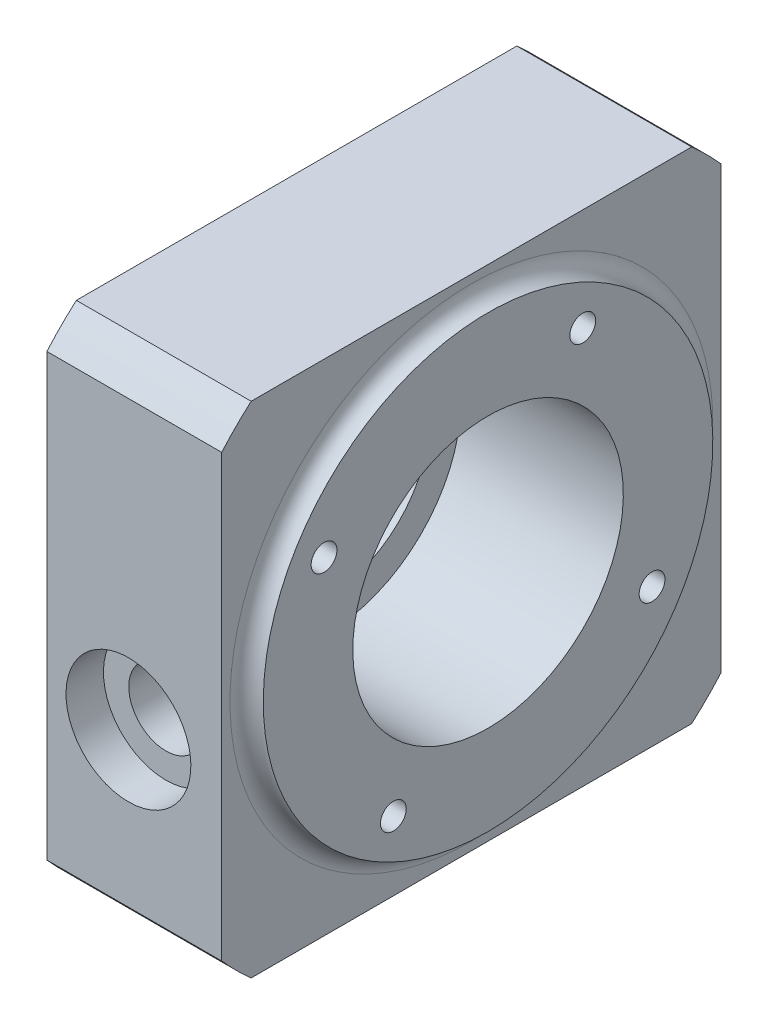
ISO-10303-21;
HEADER;
FILE_DESCRIPTION(('STEP AP214'),'2;1');
FILE_NAME('part.step','',(''),(''),'','','');
FILE_SCHEMA(('AUTOMOTIVE_DESIGN { 1 0 10303 214 1 1 1 1 }'));
ENDSEC;
DATA;
#1=APPLICATION_CONTEXT('core data for automotive mechanical design processes');
#2=APPLICATION_PROTOCOL_DEFINITION('international standard','automotive_design',2000,#1);
#3=PRODUCT_CONTEXT('',#1,'mechanical');
#4=PRODUCT('Part','Part','',(#3));
#5=PRODUCT_RELATED_PRODUCT_CATEGORY('part','',(#4));
#6=PRODUCT_DEFINITION_FORMATION('','',#4);
#7=PRODUCT_DEFINITION_CONTEXT('part definition',#1,'design');
#8=PRODUCT_DEFINITION('design','',#6,#7);
#9=PRODUCT_DEFINITION_SHAPE('','',#8);
#10=(LENGTH_UNIT() NAMED_UNIT(*) SI_UNIT(.MILLI.,.METRE.));
#11=(NAMED_UNIT(*) PLANE_ANGLE_UNIT() SI_UNIT($,.RADIAN.));
#12=(NAMED_UNIT(*) SI_UNIT($,.STERADIAN.) SOLID_ANGLE_UNIT());
#13=UNCERTAINTY_MEASURE_WITH_UNIT(LENGTH_MEASURE(1.E-05),#10,'distance_accuracy_value','');
#14=(GEOMETRIC_REPRESENTATION_CONTEXT(3) GLOBAL_UNCERTAINTY_ASSIGNED_CONTEXT((#13)) GLOBAL_UNIT_ASSIGNED_CONTEXT((#10,
#11,#12)) REPRESENTATION_CONTEXT('',''));
#15=CARTESIAN_POINT('',(0.,0.,0.));
#16=DIRECTION('',(0.,0.,1.));
#17=DIRECTION('',(1.,0.,0.));
#18=AXIS2_PLACEMENT_3D('',#15,#16,#17);
#19=CARTESIAN_POINT('',(-45.2,-8.,12.75));
#20=DIRECTION('',(0.,0.,1.));
#21=DIRECTION('',(0.,-1.,0.));
#22=AXIS2_PLACEMENT_3D('',#19,#20,#21);
#23=CYLINDRICAL_SURFACE('',#22,4.45873);
#24=CARTESIAN_POINT('',(-40.74127,-8.00000000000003,14.1443451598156));
#25=CARTESIAN_POINT('',(-40.7412657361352,-8.16556886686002,14.0507036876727));
#26=CARTESIAN_POINT('',(-40.7504902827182,-8.32943204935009,13.9541726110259));
#27=CARTESIAN_POINT('',(-40.786262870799,-8.65237658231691,13.7562618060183));
#28=CARTESIAN_POINT('',(-40.8128199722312,-8.81145538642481,13.6548795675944));
#29=CARTESIAN_POINT('',(-40.8822459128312,-9.12380042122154,13.4481940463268));
#30=CARTESIAN_POINT('',(-40.9251460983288,-9.27705485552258,13.3428835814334));
#31=CARTESIAN_POINT('',(-41.0262718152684,-9.57646114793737,13.1296481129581));
#32=CARTESIAN_POINT('',(-41.0844942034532,-9.72261445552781,13.0217236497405));
#33=CARTESIAN_POINT('',(-41.2085227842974,-9.99197770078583,12.8159467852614));
#34=CARTESIAN_POINT('',(-41.2728684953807,-10.1159764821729,12.7182409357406));
#35=CARTESIAN_POINT('',(-41.4127680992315,-10.3572427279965,12.5225454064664));
#36=CARTESIAN_POINT('',(-41.4883216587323,-10.4745103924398,12.4245557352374));
#37=CARTESIAN_POINT('',(-41.6503202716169,-10.7017596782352,12.2293605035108));
#38=CARTESIAN_POINT('',(-41.7367568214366,-10.8117468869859,12.1321543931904));
#39=CARTESIAN_POINT('',(-41.9204675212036,-11.0240109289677,11.9396066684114));
#40=CARTESIAN_POINT('',(-42.0177397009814,-11.1262891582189,11.8442647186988));
#41=CARTESIAN_POINT('',(-42.2033506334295,-11.3035573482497,11.6749333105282));
#42=CARTESIAN_POINT('',(-42.2897825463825,-11.3800008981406,11.6003783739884));
#43=CARTESIAN_POINT('',(-42.4698276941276,-11.5270314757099,11.4542929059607));
#44=CARTESIAN_POINT('',(-42.5634411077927,-11.5976183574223,11.382762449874));
#45=CARTESIAN_POINT('',(-42.8550963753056,-11.7996807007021,11.1743963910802));
#46=CARTESIAN_POINT('',(-43.0643272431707,-11.9218209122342,11.0434345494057));
#47=CARTESIAN_POINT('',(-43.4475678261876,-12.1036938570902,10.8432416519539));
#48=CARTESIAN_POINT('',(-43.6142609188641,-12.1712591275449,10.7671117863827));
#49=CARTESIAN_POINT('',(-43.9616400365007,-12.2872016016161,10.6346100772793));
#50=CARTESIAN_POINT('',(-44.1423024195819,-12.335610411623,10.5782057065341));
#51=CARTESIAN_POINT('',(-44.486514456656,-12.4042297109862,10.4976185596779));
#52=CARTESIAN_POINT('',(-44.6485933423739,-12.4275706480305,10.4698829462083));
#53=CARTESIAN_POINT('',(-44.9765522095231,-12.456161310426,10.4358551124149));
#54=CARTESIAN_POINT('',(-45.1424295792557,-12.4614231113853,10.429548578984));
#55=CARTESIAN_POINT('',(-45.4730965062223,-12.4534319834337,10.4390880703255));
#56=CARTESIAN_POINT('',(-45.6378858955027,-12.4401762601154,10.4549374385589));
#57=CARTESIAN_POINT('',(-45.9618131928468,-12.3962152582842,10.5070199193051));
#58=CARTESIAN_POINT('',(-46.120946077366,-12.3654948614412,10.5432706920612));
#59=CARTESIAN_POINT('',(-46.4768627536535,-12.2770177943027,10.6462753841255));
#60=CARTESIAN_POINT('',(-46.6705862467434,-12.2139100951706,10.7189227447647));
#61=CARTESIAN_POINT('',(-47.040208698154,-12.0661702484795,10.8849588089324));
#62=CARTESIAN_POINT('',(-47.2160659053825,-11.9814892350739,10.9783945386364));
#63=CARTESIAN_POINT('',(-47.5019212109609,-11.8210122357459,11.150599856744));
#64=CARTESIAN_POINT('',(-47.6164518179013,-11.7495085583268,11.2260125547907));
#65=CARTESIAN_POINT('',(-47.8362567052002,-11.598363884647,11.3821021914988));
#66=CARTESIAN_POINT('',(-47.9415269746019,-11.5187193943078,11.462781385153));
#67=CARTESIAN_POINT('',(-48.1430255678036,-11.3520123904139,11.6279013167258));
#68=CARTESIAN_POINT('',(-48.2392456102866,-11.264943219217,11.7123453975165));
#69=CARTESIAN_POINT('',(-48.4226456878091,-11.0840575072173,11.8836747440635));
#70=CARTESIAN_POINT('',(-48.5098268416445,-10.9902418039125,11.9705597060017));
#71=CARTESIAN_POINT('',(-48.7635105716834,-10.6927915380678,12.2392570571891));
#72=CARTESIAN_POINT('',(-48.9154846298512,-10.4787119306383,12.4235159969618));
#73=CARTESIAN_POINT('',(-49.1799628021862,-10.0269713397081,12.7909035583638));
#74=CARTESIAN_POINT('',(-49.2924901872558,-9.78932436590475,12.9740327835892));
#75=CARTESIAN_POINT('',(-49.4724251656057,-9.30087802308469,13.328329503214));
#76=CARTESIAN_POINT('',(-49.5410821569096,-9.05068502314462,13.4996909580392));
#77=CARTESIAN_POINT('',(-49.6342333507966,-8.53516825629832,13.8313859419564));
#78=CARTESIAN_POINT('',(-49.6587471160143,-8.26985124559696,13.9917243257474));
#79=CARTESIAN_POINT('',(-49.6587144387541,-7.75466124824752,14.28310236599));
#80=CARTESIAN_POINT('',(-49.6384222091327,-7.50557460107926,14.4154804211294));
#81=CARTESIAN_POINT('',(-49.5752013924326,-7.13171342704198,14.6020802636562));
#82=CARTESIAN_POINT('',(-49.5486471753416,-7.00700550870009,14.6623069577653));
#83=CARTESIAN_POINT('',(-49.4843247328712,-6.75851716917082,14.7784876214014));
#84=CARTESIAN_POINT('',(-49.4465612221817,-6.63473638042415,14.8344433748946));
#85=CARTESIAN_POINT('',(-49.359393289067,-6.38851670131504,14.9421393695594));
#86=CARTESIAN_POINT('',(-49.3099231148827,-6.26608963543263,14.9938534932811));
#87=CARTESIAN_POINT('',(-49.1994656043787,-6.02461023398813,15.0925005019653));
#88=CARTESIAN_POINT('',(-49.1384833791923,-5.90555642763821,15.1394354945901));
#89=CARTESIAN_POINT('',(-49.0051509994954,-5.67208905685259,15.2284443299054));
#90=CARTESIAN_POINT('',(-48.9328014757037,-5.55767523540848,15.2705184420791));
#91=CARTESIAN_POINT('',(-48.7770849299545,-5.33481523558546,15.3497959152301));
#92=CARTESIAN_POINT('',(-48.6937189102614,-5.22636851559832,15.3869997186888));
#93=CARTESIAN_POINT('',(-48.5244035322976,-5.0260713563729,15.4535186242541));
#94=CARTESIAN_POINT('',(-48.4393437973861,-4.93360275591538,15.4832410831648));
#95=CARTESIAN_POINT('',(-48.2610740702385,-4.75562648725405,15.5388290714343));
#96=CARTESIAN_POINT('',(-48.1678645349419,-4.67011842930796,15.5646948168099));
#97=CARTESIAN_POINT('',(-47.9739368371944,-4.50691961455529,15.6127324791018));
#98=CARTESIAN_POINT('',(-47.8732180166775,-4.42922954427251,15.634904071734));
#99=CARTESIAN_POINT('',(-47.6650274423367,-4.2824560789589,15.6757416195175));
#100=CARTESIAN_POINT('',(-47.5575559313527,-4.21337237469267,15.6944077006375));
#101=CARTESIAN_POINT('',(-47.3417886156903,-4.087470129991,15.7276549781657));
#102=CARTESIAN_POINT('',(-47.233759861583,-4.03023262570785,15.7423849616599));
#103=CARTESIAN_POINT('',(-47.0130829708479,-3.92471342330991,15.769023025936));
#104=CARTESIAN_POINT('',(-46.9004350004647,-3.87643140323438,15.7809312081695));
#105=CARTESIAN_POINT('',(-46.6714627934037,-3.78929254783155,15.8020812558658));
#106=CARTESIAN_POINT('',(-46.5551431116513,-3.75042451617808,15.8113262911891));
#107=CARTESIAN_POINT('',(-46.3195762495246,-3.68237892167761,15.8273120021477));
#108=CARTESIAN_POINT('',(-46.2003298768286,-3.65319871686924,15.8340533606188));
#109=CARTESIAN_POINT('',(-45.9353941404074,-3.59986082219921,15.8462742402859));
#110=CARTESIAN_POINT('',(-45.7892307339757,-3.57790967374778,15.8512234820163));
#111=CARTESIAN_POINT('',(-45.4953723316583,-3.54861466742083,15.857807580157));
#112=CARTESIAN_POINT('',(-45.3476773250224,-3.54127091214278,15.859442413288));
#113=CARTESIAN_POINT('',(-45.0778430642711,-3.54126924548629,15.8594420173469));
#114=CARTESIAN_POINT('',(-44.9556982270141,-3.54629275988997,15.8583230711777));
#115=CARTESIAN_POINT('',(-44.7122320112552,-3.5663472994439,15.8538252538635));
#116=CARTESIAN_POINT('',(-44.5909108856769,-3.58138126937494,15.8504457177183));
#117=CARTESIAN_POINT('',(-44.3498854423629,-3.62135679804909,15.8413602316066));
#118=CARTESIAN_POINT('',(-44.2301827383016,-3.6463075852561,15.8356521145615));
#119=CARTESIAN_POINT('',(-43.9933168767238,-3.70592166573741,15.8218071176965));
#120=CARTESIAN_POINT('',(-43.876154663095,-3.74058850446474,15.81366935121));
#121=CARTESIAN_POINT('',(-43.6453412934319,-3.81931035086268,15.7948410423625));
#122=CARTESIAN_POINT('',(-43.5316874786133,-3.86335803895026,15.7841524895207));
#123=CARTESIAN_POINT('',(-43.3085630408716,-3.96050127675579,15.7600581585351));
#124=CARTESIAN_POINT('',(-43.1990939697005,-4.01360014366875,15.7466513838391));
#125=CARTESIAN_POINT('',(-42.9852341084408,-4.12833373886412,15.7169611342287));
#126=CARTESIAN_POINT('',(-42.8808397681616,-4.18996238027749,15.7006797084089));
#127=CARTESIAN_POINT('',(-42.6777367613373,-4.32126524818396,15.6650500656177));
#128=CARTESIAN_POINT('',(-42.579030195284,-4.39094241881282,15.6457007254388));
#129=CARTESIAN_POINT('',(-42.3881206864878,-4.53761901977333,15.6037919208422));
#130=CARTESIAN_POINT('',(-42.2959107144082,-4.61461031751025,15.5812360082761));
#131=CARTESIAN_POINT('',(-42.118441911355,-4.77531265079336,15.5327374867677));
#132=CARTESIAN_POINT('',(-42.0331856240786,-4.85902612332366,15.5067936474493));
#133=CARTESIAN_POINT('',(-41.8702052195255,-5.03236009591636,15.4514117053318));
#134=CARTESIAN_POINT('',(-41.7924786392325,-5.12197864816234,15.421974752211));
#135=CARTESIAN_POINT('',(-41.644921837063,-5.30636982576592,15.359505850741));
#136=CARTESIAN_POINT('',(-41.5750945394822,-5.40114434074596,15.3264725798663));
#137=CARTESIAN_POINT('',(-41.4428709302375,-5.59619026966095,15.2563433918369));
#138=CARTESIAN_POINT('',(-41.3805777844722,-5.69651537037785,15.2192020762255));
#139=CARTESIAN_POINT('',(-41.2646528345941,-5.90068498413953,15.1412153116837));
#140=CARTESIAN_POINT('',(-41.2110242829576,-6.00453080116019,15.1003684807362));
#141=CARTESIAN_POINT('',(-41.063409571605,-6.31993012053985,14.9723807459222));
#142=CARTESIAN_POINT('',(-40.9825502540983,-6.5355607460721,14.8797164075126));
#143=CARTESIAN_POINT('',(-40.8587495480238,-6.96047399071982,14.6855868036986));
#144=CARTESIAN_POINT('',(-40.8142224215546,-7.1695867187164,14.5847296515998));
#145=CARTESIAN_POINT('',(-40.755477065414,-7.58667468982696,14.3721822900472));
#146=CARTESIAN_POINT('',(-40.7412752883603,-7.79464925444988,14.2604862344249));
#147=CARTESIAN_POINT('',(-40.74127,-8.00000000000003,14.1443451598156));
#148=B_SPLINE_CURVE_WITH_KNOTS('',3,(#24,#25,#26,#27,#28,#29,#30,#31,#32,#33,#34,#35,#36,#37,
#38,#39,#40,#41,#42,#43,#44,#45,#46,#47,#48,#49,#50,#51,#52,#53,#54,#55,#56,#57,#58,#59,#60,#61,
#62,#63,#64,#65,#66,#67,#68,#69,#70,#71,#72,#73,#74,#75,#76,#77,#78,#79,#80,#81,#82,#83,#84,#85,
#86,#87,#88,#89,#90,#91,#92,#93,#94,#95,#96,#97,#98,#99,#100,#101,#102,#103,#104,#105,#106,#107,
#108,#109,#110,#111,#112,#113,#114,#115,#116,#117,#118,#119,#120,#121,#122,#123,#124,#125,#126,
#127,#128,#129,#130,#131,#132,#133,#134,#135,#136,#137,#138,#139,#140,#141,#142,#143,#144,#145,
#146,#147),.UNSPECIFIED.,.T.,.F.,(4,2,2,2,2,2,2,2,2,2,2,2,2,2,2,2,2,2,2,2,2,2,2,2,2,2,2,2,2,2,2,
2,2,2,2,2,2,2,2,2,2,2,2,2,2,2,2,2,2,2,2,2,2,2,2,2,2,2,2,2,2,4),(0.,0.570315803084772,
1.14092995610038,1.71264411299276,2.28424107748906,2.79517961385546,3.30610296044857,
3.81662953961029,4.327063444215,4.73884637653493,5.15063956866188,5.97235634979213,
6.5564018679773,7.13947970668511,7.63552546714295,8.13123983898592,8.62702902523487,
9.12324804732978,9.76862072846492,10.4154684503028,10.8788487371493,11.3424287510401,
11.8064289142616,12.2703715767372,13.2289482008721,14.1869583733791,15.1163011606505,
16.0452319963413,16.8897814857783,17.3123881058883,17.7348172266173,18.1596777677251,
18.5843501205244,19.0089989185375,19.4336091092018,19.820444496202,20.2072582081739,
20.5941058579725,20.9809396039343,21.3499168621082,21.7188808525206,22.0874038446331,
22.4558262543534,22.8986990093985,23.3415748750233,23.7079165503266,24.0743660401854,
24.4411573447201,24.8080826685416,25.1747227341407,25.5414974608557,25.9080117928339,
26.2746606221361,26.6409064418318,27.0072856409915,27.3735445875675,27.7399386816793,
28.1108874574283,28.4819751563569,29.223349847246,29.9303142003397,30.6376620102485),.UNSPECIFIED.);
#149=CARTESIAN_POINT('',(-40.74127,-8.00000000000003,14.1443451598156));
#150=VERTEX_POINT('',#149);
#151=EDGE_CURVE('E158',#150,#150,#148,.T.);
#152=ORIENTED_EDGE('',*,*,#151,.T.);
#153=EDGE_LOOP('',(#152));
#154=FACE_BOUND('',#153,.T.);
#155=CARTESIAN_POINT('',(-45.2,-8.,25.5));
#156=DIRECTION('',(0.,0.,1.));
#157=DIRECTION('',(0.,-1.,0.));
#158=AXIS2_PLACEMENT_3D('',#155,#156,#157);
#159=CIRCLE('',#158,4.45873);
#160=CARTESIAN_POINT('',(-45.2,-12.45873,25.5));
#161=VERTEX_POINT('',#160);
#162=EDGE_CURVE('E180',#161,#161,#159,.T.);
#163=ORIENTED_EDGE('',*,*,#162,.T.);
#164=EDGE_LOOP('',(#163));
#165=FACE_BOUND('',#164,.T.);
#166=ADVANCED_FACE('F17',(#154,#165),#23,.F.);
#167=CARTESIAN_POINT('',(-32.,0.,0.));
#168=DIRECTION('',(1.,0.,0.));
#169=DIRECTION('',(0.,1.,0.));
#170=AXIS2_PLACEMENT_3D('',#167,#168,#169);
#171=PLANE('',#170);
#172=CARTESIAN_POINT('',(-32.,0.,0.));
#173=DIRECTION('',(-1.,0.,0.));
#174=DIRECTION('',(0.,-1.,0.));
#175=AXIS2_PLACEMENT_3D('',#172,#173,#174);
#176=CIRCLE('',#175,27.);
#177=CARTESIAN_POINT('',(-32.,-27.,0.));
#178=VERTEX_POINT('',#177);
#179=EDGE_CURVE('E183',#178,#178,#176,.F.);
#180=ORIENTED_EDGE('',*,*,#179,.T.);
#181=EDGE_LOOP('',(#180));
#182=FACE_BOUND('',#181,.T.);
#183=CARTESIAN_POINT('',(-32.,11.375,19.70207794));
#184=DIRECTION('',(-1.,0.,0.));
#185=DIRECTION('',(0.,-1.,0.));
#186=AXIS2_PLACEMENT_3D('',#183,#184,#185);
#187=CIRCLE('',#186,1.55);
#188=CARTESIAN_POINT('',(-32.,9.825,19.70207794));
#189=VERTEX_POINT('',#188);
#190=EDGE_CURVE('E177',#189,#189,#187,.T.);
#191=ORIENTED_EDGE('',*,*,#190,.T.);
#192=EDGE_LOOP('',(#191));
#193=FACE_BOUND('',#192,.T.);
#194=CARTESIAN_POINT('',(-32.,19.70207794,-11.375));
#195=DIRECTION('',(-1.,0.,0.));
#196=DIRECTION('',(0.,-1.,0.));
#197=AXIS2_PLACEMENT_3D('',#194,#195,#196);
#198=CIRCLE('',#197,1.55);
#199=CARTESIAN_POINT('',(-32.,18.15207794,-11.375));
#200=VERTEX_POINT('',#199);
#201=EDGE_CURVE('E173',#200,#200,#198,.T.);
#202=ORIENTED_EDGE('',*,*,#201,.T.);
#203=EDGE_LOOP('',(#202));
#204=FACE_BOUND('',#203,.T.);
#205=CARTESIAN_POINT('',(-32.,-11.375,-19.70207794));
#206=DIRECTION('',(-1.,0.,0.));
#207=DIRECTION('',(0.,-1.,0.));
#208=AXIS2_PLACEMENT_3D('',#205,#206,#207);
#209=CIRCLE('',#208,1.55);
#210=CARTESIAN_POINT('',(-32.,-12.925,-19.70207794));
#211=VERTEX_POINT('',#210);
#212=EDGE_CURVE('E170',#211,#211,#209,.T.);
#213=ORIENTED_EDGE('',*,*,#212,.T.);
#214=EDGE_LOOP('',(#213));
#215=FACE_BOUND('',#214,.T.);
#216=CARTESIAN_POINT('',(-32.,-19.70207794,11.375));
#217=DIRECTION('',(-1.,0.,0.));
#218=DIRECTION('',(0.,-1.,0.));
#219=AXIS2_PLACEMENT_3D('',#216,#217,#218);
#220=CIRCLE('',#219,1.55);
#221=CARTESIAN_POINT('',(-32.,-21.25207794,11.375));
#222=VERTEX_POINT('',#221);
#223=EDGE_CURVE('E167',#222,#222,#220,.T.);
#224=ORIENTED_EDGE('',*,*,#223,.T.);
#225=EDGE_LOOP('',(#224));
#226=FACE_BOUND('',#225,.T.);
#227=CARTESIAN_POINT('',(-32.,0.,0.));
#228=DIRECTION('',(-1.,0.,0.));
#229=DIRECTION('',(0.,-1.,0.));
#230=AXIS2_PLACEMENT_3D('',#227,#228,#229);
#231=CIRCLE('',#230,16.25);
#232=CARTESIAN_POINT('',(-32.,-16.25,0.));
#233=VERTEX_POINT('',#232);
#234=EDGE_CURVE('E163',#233,#233,#231,.T.);
#235=ORIENTED_EDGE('',*,*,#234,.T.);
#236=EDGE_LOOP('',(#235));
#237=FACE_BOUND('',#236,.T.);
#238=ADVANCED_FACE('F155',(#182,#193,#204,#215,#226,#237),#171,.T.);
#239=CARTESIAN_POINT('',(-40.75,0.,0.));
#240=DIRECTION('',(-1.,0.,0.));
#241=DIRECTION('',(0.,-1.,0.));
#242=AXIS2_PLACEMENT_3D('',#239,#240,#241);
#243=CYLINDRICAL_SURFACE('',#242,16.25);
#244=CARTESIAN_POINT('',(-51.5,0.,0.));
#245=DIRECTION('',(-1.,0.,0.));
#246=DIRECTION('',(0.,-1.,0.));
#247=AXIS2_PLACEMENT_3D('',#244,#245,#246);
#248=CIRCLE('',#247,16.25);
#249=CARTESIAN_POINT('',(-51.5,-16.25,0.));
#250=VERTEX_POINT('',#249);
#251=EDGE_CURVE('E187',#250,#250,#248,.T.);
#252=ORIENTED_EDGE('',*,*,#251,.T.);
#253=EDGE_LOOP('',(#252));
#254=FACE_BOUND('',#253,.T.);
#255=ORIENTED_EDGE('',*,*,#234,.F.);
#256=EDGE_LOOP('',(#255));
#257=FACE_BOUND('',#256,.T.);
#258=ORIENTED_EDGE('',*,*,#151,.F.);
#259=EDGE_LOOP('',(#258));
#260=FACE_BOUND('',#259,.T.);
#261=ADVANCED_FACE('F151',(#254,#257,#260),#243,.F.);
#262=CARTESIAN_POINT('',(-39.3,-19.70207794,11.375));
#263=DIRECTION('',(-1.,0.,0.));
#264=DIRECTION('',(0.,-1.,0.));
#265=AXIS2_PLACEMENT_3D('',#262,#263,#264);
#266=CYLINDRICAL_SURFACE('',#265,1.55);
#267=ORIENTED_EDGE('',*,*,#223,.F.);
#268=EDGE_LOOP('',(#267));
#269=FACE_BOUND('',#268,.T.);
#270=CARTESIAN_POINT('',(-46.6,-19.70207794,11.375));
#271=DIRECTION('',(-1.,0.,0.));
#272=DIRECTION('',(0.,-1.,0.));
#273=AXIS2_PLACEMENT_3D('',#270,#271,#272);
#274=CIRCLE('',#273,1.55);
#275=CARTESIAN_POINT('',(-46.6,-21.25207794,11.375));
#276=VERTEX_POINT('',#275);
#277=EDGE_CURVE('E191',#276,#276,#274,.T.);
#278=ORIENTED_EDGE('',*,*,#277,.T.);
#279=EDGE_LOOP('',(#278));
#280=FACE_BOUND('',#279,.T.);
#281=ADVANCED_FACE('F147',(#269,#280),#266,.F.);
#282=CARTESIAN_POINT('',(-39.3,-11.375,-19.70207794));
#283=DIRECTION('',(-1.,0.,0.));
#284=DIRECTION('',(0.,-1.,0.));
#285=AXIS2_PLACEMENT_3D('',#282,#283,#284);
#286=CYLINDRICAL_SURFACE('',#285,1.55);
#287=ORIENTED_EDGE('',*,*,#212,.F.);
#288=EDGE_LOOP('',(#287));
#289=FACE_BOUND('',#288,.T.);
#290=CARTESIAN_POINT('',(-46.6,-11.375,-19.70207794));
#291=DIRECTION('',(-1.,0.,0.));
#292=DIRECTION('',(0.,-1.,0.));
#293=AXIS2_PLACEMENT_3D('',#290,#291,#292);
#294=CIRCLE('',#293,1.55);
#295=CARTESIAN_POINT('',(-46.6,-12.925,-19.70207794));
#296=VERTEX_POINT('',#295);
#297=EDGE_CURVE('E194',#296,#296,#294,.T.);
#298=ORIENTED_EDGE('',*,*,#297,.T.);
#299=EDGE_LOOP('',(#298));
#300=FACE_BOUND('',#299,.T.);
#301=ADVANCED_FACE('F143',(#289,#300),#286,.F.);
#302=CARTESIAN_POINT('',(-39.3,19.70207794,-11.375));
#303=DIRECTION('',(-1.,0.,0.));
#304=DIRECTION('',(0.,-1.,0.));
#305=AXIS2_PLACEMENT_3D('',#302,#303,#304);
#306=CYLINDRICAL_SURFACE('',#305,1.55);
#307=ORIENTED_EDGE('',*,*,#201,.F.);
#308=EDGE_LOOP('',(#307));
#309=FACE_BOUND('',#308,.T.);
#310=CARTESIAN_POINT('',(-46.6,19.70207794,-11.375));
#311=DIRECTION('',(-1.,0.,0.));
#312=DIRECTION('',(0.,-1.,0.));
#313=AXIS2_PLACEMENT_3D('',#310,#311,#312);
#314=CIRCLE('',#313,1.55);
#315=CARTESIAN_POINT('',(-46.6,18.15207794,-11.375));
#316=VERTEX_POINT('',#315);
#317=EDGE_CURVE('E197',#316,#316,#314,.T.);
#318=ORIENTED_EDGE('',*,*,#317,.T.);
#319=EDGE_LOOP('',(#318));
#320=FACE_BOUND('',#319,.T.);
#321=ADVANCED_FACE('F139',(#309,#320),#306,.F.);
#322=CARTESIAN_POINT('',(-39.3,11.375,19.70207794));
#323=DIRECTION('',(-1.,0.,0.));
#324=DIRECTION('',(0.,-1.,0.));
#325=AXIS2_PLACEMENT_3D('',#322,#323,#324);
#326=CYLINDRICAL_SURFACE('',#325,1.55);
#327=ORIENTED_EDGE('',*,*,#190,.F.);
#328=EDGE_LOOP('',(#327));
#329=FACE_BOUND('',#328,.T.);
#330=CARTESIAN_POINT('',(-46.6,11.375,19.70207794));
#331=DIRECTION('',(-1.,0.,0.));
#332=DIRECTION('',(0.,-1.,0.));
#333=AXIS2_PLACEMENT_3D('',#330,#331,#332);
#334=CIRCLE('',#333,1.55);
#335=CARTESIAN_POINT('',(-46.6,9.825,19.70207794));
#336=VERTEX_POINT('',#335);
#337=EDGE_CURVE('E201',#336,#336,#334,.T.);
#338=ORIENTED_EDGE('',*,*,#337,.T.);
#339=EDGE_LOOP('',(#338));
#340=FACE_BOUND('',#339,.T.);
#341=ADVANCED_FACE('F135',(#329,#340),#326,.F.);
#342=CARTESIAN_POINT('',(-45.2,-8.,25.5));
#343=DIRECTION('',(0.,0.,-1.));
#344=DIRECTION('',(0.,1.,0.));
#345=AXIS2_PLACEMENT_3D('',#342,#343,#344);
#346=PLANE('',#345);
#347=CARTESIAN_POINT('',(-45.2,-8.,25.5));
#348=DIRECTION('',(0.,0.,1.));
#349=DIRECTION('',(0.,-1.,0.));
#350=AXIS2_PLACEMENT_3D('',#347,#348,#349);
#351=CIRCLE('',#350,7.5);
#352=CARTESIAN_POINT('',(-45.2,-15.5,25.5));
#353=VERTEX_POINT('',#352);
#354=EDGE_CURVE('E105',#353,#353,#351,.T.);
#355=ORIENTED_EDGE('',*,*,#354,.T.);
#356=EDGE_LOOP('',(#355));
#357=FACE_BOUND('',#356,.T.);
#358=ORIENTED_EDGE('',*,*,#162,.F.);
#359=EDGE_LOOP('',(#358));
#360=FACE_BOUND('',#359,.T.);
#361=ADVANCED_FACE('F130',(#357,#360),#346,.F.);
#362=CARTESIAN_POINT('',(-32.,0.,0.));
#363=DIRECTION('',(-1.,0.,0.));
#364=DIRECTION('',(0.,1.,0.));
#365=AXIS2_PLACEMENT_3D('',#362,#363,#364);
#366=TOROIDAL_SURFACE('',#365,29.,2.);
#367=CARTESIAN_POINT('',(-34.,0.,0.));
#368=DIRECTION('',(1.,0.,0.));
#369=DIRECTION('',(0.,1.,0.));
#370=AXIS2_PLACEMENT_3D('',#367,#368,#369);
#371=CIRCLE('',#370,29.);
#372=CARTESIAN_POINT('',(-34.,29.,0.));
#373=VERTEX_POINT('',#372);
#374=CARTESIAN_POINT('',(-34.,-29.,0.));
#375=VERTEX_POINT('',#374);
#376=EDGE_CURVE('E97',#373,#375,#371,.T.);
#377=ORIENTED_EDGE('',*,*,#376,.T.);
#378=CARTESIAN_POINT('',(-34.,0.,0.));
#379=DIRECTION('',(1.,0.,0.));
#380=DIRECTION('',(0.,-1.,0.));
#381=AXIS2_PLACEMENT_3D('',#378,#379,#380);
#382=CIRCLE('',#381,29.);
#383=EDGE_CURVE('E100',#375,#373,#382,.T.);
#384=ORIENTED_EDGE('',*,*,#383,.T.);
#385=EDGE_LOOP('',(#377,#384));
#386=FACE_BOUND('',#385,.T.);
#387=ORIENTED_EDGE('',*,*,#179,.F.);
#388=EDGE_LOOP('',(#387));
#389=FACE_BOUND('',#388,.T.);
#390=ADVANCED_FACE('F109',(#386,#389),#366,.F.);
#391=CARTESIAN_POINT('',(-51.5,0.,0.));
#392=DIRECTION('',(-1.,0.,0.));
#393=DIRECTION('',(0.,-1.,0.));
#394=AXIS2_PLACEMENT_3D('',#391,#392,#393);
#395=PLANE('',#394);
#396=ORIENTED_EDGE('',*,*,#251,.F.);
#397=EDGE_LOOP('',(#396));
#398=FACE_BOUND('',#397,.T.);
#399=CARTESIAN_POINT('',(-51.5,0.,0.));
#400=DIRECTION('',(-1.,0.,0.));
#401=DIRECTION('',(0.,-1.,0.));
#402=AXIS2_PLACEMENT_3D('',#399,#400,#401);
#403=CIRCLE('',#402,12.5);
#404=CARTESIAN_POINT('',(-51.5,-12.5,0.));
#405=VERTEX_POINT('',#404);
#406=EDGE_CURVE('E112',#405,#405,#403,.T.);
#407=ORIENTED_EDGE('',*,*,#406,.T.);
#408=EDGE_LOOP('',(#407));
#409=FACE_BOUND('',#408,.T.);
#410=ADVANCED_FACE('F129',(#398,#409),#395,.F.);
#411=CARTESIAN_POINT('',(-46.6,-19.70207794,11.375));
#412=DIRECTION('',(1.,0.,0.));
#413=DIRECTION('',(0.,1.,0.));
#414=AXIS2_PLACEMENT_3D('',#411,#412,#413);
#415=PLANE('',#414);
#416=CARTESIAN_POINT('',(-46.6,-19.70207794,11.375));
#417=DIRECTION('',(-1.,0.,0.));
#418=DIRECTION('',(0.,-1.,0.));
#419=AXIS2_PLACEMENT_3D('',#416,#417,#418);
#420=CIRCLE('',#419,4.);
#421=CARTESIAN_POINT('',(-46.6,-23.70207794,11.375));
#422=VERTEX_POINT('',#421);
#423=EDGE_CURVE('E209',#422,#422,#420,.T.);
#424=ORIENTED_EDGE('',*,*,#423,.T.);
#425=EDGE_LOOP('',(#424));
#426=FACE_BOUND('',#425,.T.);
#427=ORIENTED_EDGE('',*,*,#277,.F.);
#428=EDGE_LOOP('',(#427));
#429=FACE_BOUND('',#428,.T.);
#430=ADVANCED_FACE('F565',(#426,#429),#415,.F.);
#431=CARTESIAN_POINT('',(-46.6,-11.375,-19.70207794));
#432=DIRECTION('',(1.,0.,0.));
#433=DIRECTION('',(0.,1.,0.));
#434=AXIS2_PLACEMENT_3D('',#431,#432,#433);
#435=PLANE('',#434);
#436=CARTESIAN_POINT('',(-46.6,-11.375,-19.70207794));
#437=DIRECTION('',(-1.,0.,0.));
#438=DIRECTION('',(0.,-1.,0.));
#439=AXIS2_PLACEMENT_3D('',#436,#437,#438);
#440=CIRCLE('',#439,4.);
#441=CARTESIAN_POINT('',(-46.6,-15.375,-19.70207794));
#442=VERTEX_POINT('',#441);
#443=EDGE_CURVE('E212',#442,#442,#440,.T.);
#444=ORIENTED_EDGE('',*,*,#443,.T.);
#445=EDGE_LOOP('',(#444));
#446=FACE_BOUND('',#445,.T.);
#447=ORIENTED_EDGE('',*,*,#297,.F.);
#448=EDGE_LOOP('',(#447));
#449=FACE_BOUND('',#448,.T.);
#450=ADVANCED_FACE('F557',(#446,#449),#435,.F.);
#451=CARTESIAN_POINT('',(-46.6,19.70207794,-11.375));
#452=DIRECTION('',(1.,0.,0.));
#453=DIRECTION('',(0.,1.,0.));
#454=AXIS2_PLACEMENT_3D('',#451,#452,#453);
#455=PLANE('',#454);
#456=CARTESIAN_POINT('',(-46.6,19.70207794,-11.375));
#457=DIRECTION('',(-1.,0.,0.));
#458=DIRECTION('',(0.,-1.,0.));
#459=AXIS2_PLACEMENT_3D('',#456,#457,#458);
#460=CIRCLE('',#459,4.);
#461=CARTESIAN_POINT('',(-46.6,15.70207794,-11.375));
#462=VERTEX_POINT('',#461);
#463=EDGE_CURVE('E215',#462,#462,#460,.T.);
#464=ORIENTED_EDGE('',*,*,#463,.T.);
#465=EDGE_LOOP('',(#464));
#466=FACE_BOUND('',#465,.T.);
#467=ORIENTED_EDGE('',*,*,#317,.F.);
#468=EDGE_LOOP('',(#467));
#469=FACE_BOUND('',#468,.T.);
#470=ADVANCED_FACE('F548',(#466,#469),#455,.F.);
#471=CARTESIAN_POINT('',(-46.6,11.375,19.70207794));
#472=DIRECTION('',(1.,0.,0.));
#473=DIRECTION('',(0.,1.,0.));
#474=AXIS2_PLACEMENT_3D('',#471,#472,#473);
#475=PLANE('',#474);
#476=CARTESIAN_POINT('',(-46.6,11.375,19.70207794));
#477=DIRECTION('',(-1.,0.,0.));
#478=DIRECTION('',(0.,-1.,0.));
#479=AXIS2_PLACEMENT_3D('',#476,#477,#478);
#480=CIRCLE('',#479,4.);
#481=CARTESIAN_POINT('',(-46.6,7.375,19.70207794));
#482=VERTEX_POINT('',#481);
#483=EDGE_CURVE('E219',#482,#482,#480,.T.);
#484=ORIENTED_EDGE('',*,*,#483,.T.);
#485=EDGE_LOOP('',(#484));
#486=FACE_BOUND('',#485,.T.);
#487=ORIENTED_EDGE('',*,*,#337,.F.);
#488=EDGE_LOOP('',(#487));
#489=FACE_BOUND('',#488,.T.);
#490=ADVANCED_FACE('F540',(#486,#489),#475,.F.);
#491=CARTESIAN_POINT('',(-48.4,16.97056275,-16.97056275));
#492=DIRECTION('',(1.,0.,0.));
#493=DIRECTION('',(0.,1.,0.));
#494=AXIS2_PLACEMENT_3D('',#491,#492,#493);
#495=PLANE('',#494);
#496=CARTESIAN_POINT('',(-48.4,16.97056275,-16.97056275));
#497=DIRECTION('',(-1.,0.,0.));
#498=DIRECTION('',(0.,-1.,0.));
#499=AXIS2_PLACEMENT_3D('',#496,#497,#498);
#500=CIRCLE('',#499,0.95873);
#501=CARTESIAN_POINT('',(-48.4,16.01183275,-16.97056275));
#502=VERTEX_POINT('',#501);
#503=EDGE_CURVE('E223',#502,#502,#500,.T.);
#504=ORIENTED_EDGE('',*,*,#503,.T.);
#505=EDGE_LOOP('',(#504));
#506=FACE_BOUND('',#505,.T.);
#507=ADVANCED_FACE('F532',(#506),#495,.F.);
#508=CARTESIAN_POINT('',(-48.4,16.97056275,16.97056275));
#509=DIRECTION('',(1.,0.,0.));
#510=DIRECTION('',(0.,1.,0.));
#511=AXIS2_PLACEMENT_3D('',#508,#509,#510);
#512=PLANE('',#511);
#513=CARTESIAN_POINT('',(-48.4,16.97056275,16.97056275));
#514=DIRECTION('',(-1.,0.,0.));
#515=DIRECTION('',(0.,-1.,0.));
#516=AXIS2_PLACEMENT_3D('',#513,#514,#515);
#517=CIRCLE('',#516,0.95873);
#518=CARTESIAN_POINT('',(-48.4,16.01183275,16.97056275));
#519=VERTEX_POINT('',#518);
#520=EDGE_CURVE('E227',#519,#519,#517,.T.);
#521=ORIENTED_EDGE('',*,*,#520,.T.);
#522=EDGE_LOOP('',(#521));
#523=FACE_BOUND('',#522,.T.);
#524=ADVANCED_FACE('F524',(#523),#512,.F.);
#525=CARTESIAN_POINT('',(-48.4,-16.97056275,16.97056275));
#526=DIRECTION('',(1.,0.,0.));
#527=DIRECTION('',(0.,1.,0.));
#528=AXIS2_PLACEMENT_3D('',#525,#526,#527);
#529=PLANE('',#528);
#530=CARTESIAN_POINT('',(-48.4,-16.97056275,16.97056275));
#531=DIRECTION('',(-1.,0.,0.));
#532=DIRECTION('',(0.,-1.,0.));
#533=AXIS2_PLACEMENT_3D('',#530,#531,#532);
#534=CIRCLE('',#533,0.95873);
#535=CARTESIAN_POINT('',(-48.4,-17.92929275,16.97056275));
#536=VERTEX_POINT('',#535);
#537=EDGE_CURVE('E230',#536,#536,#534,.T.);
#538=ORIENTED_EDGE('',*,*,#537,.T.);
#539=EDGE_LOOP('',(#538));
#540=FACE_BOUND('',#539,.T.);
#541=ADVANCED_FACE('F516',(#540),#529,.F.);
#542=CARTESIAN_POINT('',(-48.4,-16.97056275,-16.97056275));
#543=DIRECTION('',(1.,0.,0.));
#544=DIRECTION('',(0.,1.,0.));
#545=AXIS2_PLACEMENT_3D('',#542,#543,#544);
#546=PLANE('',#545);
#547=CARTESIAN_POINT('',(-48.4,-16.97056275,-16.97056275));
#548=DIRECTION('',(-1.,0.,0.));
#549=DIRECTION('',(0.,-1.,0.));
#550=AXIS2_PLACEMENT_3D('',#547,#548,#549);
#551=CIRCLE('',#550,0.95873);
#552=CARTESIAN_POINT('',(-48.4,-17.92929275,-16.97056275));
#553=VERTEX_POINT('',#552);
#554=EDGE_CURVE('E233',#553,#553,#551,.T.);
#555=ORIENTED_EDGE('',*,*,#554,.T.);
#556=EDGE_LOOP('',(#555));
#557=FACE_BOUND('',#556,.T.);
#558=ADVANCED_FACE('F508',(#557),#546,.F.);
#559=CARTESIAN_POINT('',(-45.2,-8.,27.75));
#560=DIRECTION('',(0.,0.,1.));
#561=DIRECTION('',(0.,-1.,0.));
#562=AXIS2_PLACEMENT_3D('',#559,#560,#561);
#563=CYLINDRICAL_SURFACE('',#562,7.5);
#564=ORIENTED_EDGE('',*,*,#354,.F.);
#565=EDGE_LOOP('',(#564));
#566=FACE_BOUND('',#565,.T.);
#567=CARTESIAN_POINT('',(-45.2,-8.,30.));
#568=DIRECTION('',(0.,0.,1.));
#569=DIRECTION('',(0.,-1.,0.));
#570=AXIS2_PLACEMENT_3D('',#567,#568,#569);
#571=CIRCLE('',#570,7.5);
#572=CARTESIAN_POINT('',(-45.2,-15.5,30.));
#573=VERTEX_POINT('',#572);
#574=EDGE_CURVE('E247',#573,#573,#571,.T.);
#575=ORIENTED_EDGE('',*,*,#574,.T.);
#576=EDGE_LOOP('',(#575));
#577=FACE_BOUND('',#576,.T.);
#578=ADVANCED_FACE('F502',(#566,#577),#563,.F.);
#579=CARTESIAN_POINT('',(-34.,0.,0.));
#580=DIRECTION('',(-1.,0.,0.));
#581=DIRECTION('',(0.,-1.,0.));
#582=AXIS2_PLACEMENT_3D('',#579,#580,#581);
#583=PLANE('',#582);
#584=ORIENTED_EDGE('',*,*,#383,.F.);
#585=ORIENTED_EDGE('',*,*,#376,.F.);
#586=EDGE_LOOP('',(#584,#585));
#587=FACE_BOUND('',#586,.T.);
#588=DIRECTION('',(0.,0.,-1.));
#589=VECTOR('',#588,1.);
#590=CARTESIAN_POINT('',(-34.,-30.,0.));
#591=LINE('',#590,#589);
#592=CARTESIAN_POINT('',(-34.,-30.,-26.4575131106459));
#593=VERTEX_POINT('',#592);
#594=CARTESIAN_POINT('',(-34.,-30.,26.4575131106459));
#595=VERTEX_POINT('',#594);
#596=EDGE_CURVE('E90',#593,#595,#591,.F.);
#597=ORIENTED_EDGE('',*,*,#596,.F.);
#598=CARTESIAN_POINT('',(-34.,0.,0.));
#599=DIRECTION('',(-1.,0.,0.));
#600=DIRECTION('',(0.,-1.,0.));
#601=AXIS2_PLACEMENT_3D('',#598,#599,#600);
#602=CIRCLE('',#601,40.);
#603=CARTESIAN_POINT('',(-34.,-26.4575131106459,-30.));
#604=VERTEX_POINT('',#603);
#605=EDGE_CURVE('E86',#604,#593,#602,.T.);
#606=ORIENTED_EDGE('',*,*,#605,.F.);
#607=DIRECTION('',(0.,-1.,0.));
#608=VECTOR('',#607,1.);
#609=CARTESIAN_POINT('',(-34.,0.,-30.));
#610=LINE('',#609,#608);
#611=CARTESIAN_POINT('',(-34.,26.4575131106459,-30.));
#612=VERTEX_POINT('',#611);
#613=EDGE_CURVE('E242',#604,#612,#610,.F.);
#614=ORIENTED_EDGE('',*,*,#613,.T.);
#615=CARTESIAN_POINT('',(-34.,0.,0.));
#616=DIRECTION('',(-1.,0.,0.));
#617=DIRECTION('',(0.,-1.,0.));
#618=AXIS2_PLACEMENT_3D('',#615,#616,#617);
#619=CIRCLE('',#618,40.);
#620=CARTESIAN_POINT('',(-34.,30.,-26.4575131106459));
#621=VERTEX_POINT('',#620);
#622=EDGE_CURVE('E239',#621,#612,#619,.T.);
#623=ORIENTED_EDGE('',*,*,#622,.F.);
#624=DIRECTION('',(0.,0.,-1.));
#625=VECTOR('',#624,1.);
#626=CARTESIAN_POINT('',(-34.,30.,0.));
#627=LINE('',#626,#625);
#628=CARTESIAN_POINT('',(-34.,30.,26.4575131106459));
#629=VERTEX_POINT('',#628);
#630=EDGE_CURVE('E246',#621,#629,#627,.F.);
#631=ORIENTED_EDGE('',*,*,#630,.T.);
#632=CARTESIAN_POINT('',(-34.,0.,0.));
#633=DIRECTION('',(-1.,0.,0.));
#634=DIRECTION('',(0.,-1.,0.));
#635=AXIS2_PLACEMENT_3D('',#632,#633,#634);
#636=CIRCLE('',#635,40.);
#637=CARTESIAN_POINT('',(-34.,26.4575131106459,30.));
#638=VERTEX_POINT('',#637);
#639=EDGE_CURVE('E243',#638,#629,#636,.T.);
#640=ORIENTED_EDGE('',*,*,#639,.F.);
#641=DIRECTION('',(0.,1.,0.));
#642=VECTOR('',#641,1.);
#643=CARTESIAN_POINT('',(-34.,0.,30.));
#644=LINE('',#643,#642);
#645=CARTESIAN_POINT('',(-34.,-26.4575131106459,30.));
#646=VERTEX_POINT('',#645);
#647=EDGE_CURVE('E313',#638,#646,#644,.F.);
#648=ORIENTED_EDGE('',*,*,#647,.T.);
#649=CARTESIAN_POINT('',(-34.,0.,0.));
#650=DIRECTION('',(-1.,0.,0.));
#651=DIRECTION('',(0.,-1.,0.));
#652=AXIS2_PLACEMENT_3D('',#649,#650,#651);
#653=CIRCLE('',#652,40.);
#654=EDGE_CURVE('E251',#595,#646,#653,.T.);
#655=ORIENTED_EDGE('',*,*,#654,.F.);
#656=EDGE_LOOP('',(#597,#606,#614,#623,#631,#640,#648,#655));
#657=FACE_BOUND('',#656,.T.);
#658=ADVANCED_FACE('F102',(#587,#657),#583,.F.);
#659=CARTESIAN_POINT('',(-53.25,0.,0.));
#660=DIRECTION('',(-1.,0.,0.));
#661=DIRECTION('',(0.,-1.,0.));
#662=AXIS2_PLACEMENT_3D('',#659,#660,#661);
#663=CYLINDRICAL_SURFACE('',#662,12.5);
#664=ORIENTED_EDGE('',*,*,#406,.F.);
#665=EDGE_LOOP('',(#664));
#666=FACE_BOUND('',#665,.T.);
#667=CARTESIAN_POINT('',(-55.,0.,0.));
#668=DIRECTION('',(-1.,0.,0.));
#669=DIRECTION('',(0.,-1.,0.));
#670=AXIS2_PLACEMENT_3D('',#667,#668,#669);
#671=CIRCLE('',#670,12.5);
#672=CARTESIAN_POINT('',(-55.,-12.5,0.));
#673=VERTEX_POINT('',#672);
#674=EDGE_CURVE('E253',#673,#673,#671,.T.);
#675=ORIENTED_EDGE('',*,*,#674,.T.);
#676=EDGE_LOOP('',(#675));
#677=FACE_BOUND('',#676,.T.);
#678=ADVANCED_FACE('F487',(#666,#677),#663,.F.);
#679=CARTESIAN_POINT('',(-50.8,-19.70207794,11.375));
#680=DIRECTION('',(-1.,0.,0.));
#681=DIRECTION('',(0.,-1.,0.));
#682=AXIS2_PLACEMENT_3D('',#679,#680,#681);
#683=CYLINDRICAL_SURFACE('',#682,4.);
#684=ORIENTED_EDGE('',*,*,#423,.F.);
#685=EDGE_LOOP('',(#684));
#686=FACE_BOUND('',#685,.T.);
#687=CARTESIAN_POINT('',(-55.,-19.70207794,11.375));
#688=DIRECTION('',(-1.,0.,0.));
#689=DIRECTION('',(0.,-1.,0.));
#690=AXIS2_PLACEMENT_3D('',#687,#688,#689);
#691=CIRCLE('',#690,4.);
#692=CARTESIAN_POINT('',(-55.,-23.70207794,11.375));
#693=VERTEX_POINT('',#692);
#694=EDGE_CURVE('E258',#693,#693,#691,.T.);
#695=ORIENTED_EDGE('',*,*,#694,.T.);
#696=EDGE_LOOP('',(#695));
#697=FACE_BOUND('',#696,.T.);
#698=ADVANCED_FACE('F479',(#686,#697),#683,.F.);
#699=CARTESIAN_POINT('',(-50.8,-11.375,-19.70207794));
#700=DIRECTION('',(-1.,0.,0.));
#701=DIRECTION('',(0.,-1.,0.));
#702=AXIS2_PLACEMENT_3D('',#699,#700,#701);
#703=CYLINDRICAL_SURFACE('',#702,4.);
#704=ORIENTED_EDGE('',*,*,#443,.F.);
#705=EDGE_LOOP('',(#704));
#706=FACE_BOUND('',#705,.T.);
#707=CARTESIAN_POINT('',(-55.,-11.375,-19.70207794));
#708=DIRECTION('',(-1.,0.,0.));
#709=DIRECTION('',(0.,-1.,0.));
#710=AXIS2_PLACEMENT_3D('',#707,#708,#709);
#711=CIRCLE('',#710,4.);
#712=CARTESIAN_POINT('',(-55.,-15.375,-19.70207794));
#713=VERTEX_POINT('',#712);
#714=EDGE_CURVE('E261',#713,#713,#711,.T.);
#715=ORIENTED_EDGE('',*,*,#714,.T.);
#716=EDGE_LOOP('',(#715));
#717=FACE_BOUND('',#716,.T.);
#718=ADVANCED_FACE('F471',(#706,#717),#703,.F.);
#719=CARTESIAN_POINT('',(-50.8,19.70207794,-11.375));
#720=DIRECTION('',(-1.,0.,0.));
#721=DIRECTION('',(0.,-1.,0.));
#722=AXIS2_PLACEMENT_3D('',#719,#720,#721);
#723=CYLINDRICAL_SURFACE('',#722,4.);
#724=ORIENTED_EDGE('',*,*,#463,.F.);
#725=EDGE_LOOP('',(#724));
#726=FACE_BOUND('',#725,.T.);
#727=CARTESIAN_POINT('',(-55.,19.70207794,-11.375));
#728=DIRECTION('',(-1.,0.,0.));
#729=DIRECTION('',(0.,-1.,0.));
#730=AXIS2_PLACEMENT_3D('',#727,#728,#729);
#731=CIRCLE('',#730,4.);
#732=CARTESIAN_POINT('',(-55.,15.70207794,-11.375));
#733=VERTEX_POINT('',#732);
#734=EDGE_CURVE('E264',#733,#733,#731,.T.);
#735=ORIENTED_EDGE('',*,*,#734,.T.);
#736=EDGE_LOOP('',(#735));
#737=FACE_BOUND('',#736,.T.);
#738=ADVANCED_FACE('F462',(#726,#737),#723,.F.);
#739=CARTESIAN_POINT('',(-50.8,11.375,19.70207794));
#740=DIRECTION('',(-1.,0.,0.));
#741=DIRECTION('',(0.,-1.,0.));
#742=AXIS2_PLACEMENT_3D('',#739,#740,#741);
#743=CYLINDRICAL_SURFACE('',#742,4.);
#744=ORIENTED_EDGE('',*,*,#483,.F.);
#745=EDGE_LOOP('',(#744));
#746=FACE_BOUND('',#745,.T.);
#747=CARTESIAN_POINT('',(-55.,11.375,19.70207794));
#748=DIRECTION('',(-1.,0.,0.));
#749=DIRECTION('',(0.,-1.,0.));
#750=AXIS2_PLACEMENT_3D('',#747,#748,#749);
#751=CIRCLE('',#750,4.);
#752=CARTESIAN_POINT('',(-55.,7.375,19.70207794));
#753=VERTEX_POINT('',#752);
#754=EDGE_CURVE('E268',#753,#753,#751,.T.);
#755=ORIENTED_EDGE('',*,*,#754,.T.);
#756=EDGE_LOOP('',(#755));
#757=FACE_BOUND('',#756,.T.);
#758=ADVANCED_FACE('F454',(#746,#757),#743,.F.);
#759=CARTESIAN_POINT('',(-51.7,16.97056275,-16.97056275));
#760=DIRECTION('',(-1.,0.,0.));
#761=DIRECTION('',(0.,-1.,0.));
#762=AXIS2_PLACEMENT_3D('',#759,#760,#761);
#763=CYLINDRICAL_SURFACE('',#762,0.95873);
#764=ORIENTED_EDGE('',*,*,#503,.F.);
#765=EDGE_LOOP('',(#764));
#766=FACE_BOUND('',#765,.T.);
#767=CARTESIAN_POINT('',(-55.,16.97056275,-16.97056275));
#768=DIRECTION('',(-1.,0.,0.));
#769=DIRECTION('',(0.,-1.,0.));
#770=AXIS2_PLACEMENT_3D('',#767,#768,#769);
#771=CIRCLE('',#770,0.95873);
#772=CARTESIAN_POINT('',(-55.,16.01183275,-16.97056275));
#773=VERTEX_POINT('',#772);
#774=EDGE_CURVE('E272',#773,#773,#771,.T.);
#775=ORIENTED_EDGE('',*,*,#774,.T.);
#776=EDGE_LOOP('',(#775));
#777=FACE_BOUND('',#776,.T.);
#778=ADVANCED_FACE('F446',(#766,#777),#763,.F.);
#779=CARTESIAN_POINT('',(-51.7,16.97056275,16.97056275));
#780=DIRECTION('',(-1.,0.,0.));
#781=DIRECTION('',(0.,-1.,0.));
#782=AXIS2_PLACEMENT_3D('',#779,#780,#781);
#783=CYLINDRICAL_SURFACE('',#782,0.95873);
#784=ORIENTED_EDGE('',*,*,#520,.F.);
#785=EDGE_LOOP('',(#784));
#786=FACE_BOUND('',#785,.T.);
#787=CARTESIAN_POINT('',(-55.,16.97056275,16.97056275));
#788=DIRECTION('',(-1.,0.,0.));
#789=DIRECTION('',(0.,-1.,0.));
#790=AXIS2_PLACEMENT_3D('',#787,#788,#789);
#791=CIRCLE('',#790,0.95873);
#792=CARTESIAN_POINT('',(-55.,16.01183275,16.97056275));
#793=VERTEX_POINT('',#792);
#794=EDGE_CURVE('E276',#793,#793,#791,.T.);
#795=ORIENTED_EDGE('',*,*,#794,.T.);
#796=EDGE_LOOP('',(#795));
#797=FACE_BOUND('',#796,.T.);
#798=ADVANCED_FACE('F438',(#786,#797),#783,.F.);
#799=CARTESIAN_POINT('',(-51.7,-16.97056275,16.97056275));
#800=DIRECTION('',(-1.,0.,0.));
#801=DIRECTION('',(0.,-1.,0.));
#802=AXIS2_PLACEMENT_3D('',#799,#800,#801);
#803=CYLINDRICAL_SURFACE('',#802,0.95873);
#804=ORIENTED_EDGE('',*,*,#537,.F.);
#805=EDGE_LOOP('',(#804));
#806=FACE_BOUND('',#805,.T.);
#807=CARTESIAN_POINT('',(-55.,-16.97056275,16.97056275));
#808=DIRECTION('',(-1.,0.,0.));
#809=DIRECTION('',(0.,-1.,0.));
#810=AXIS2_PLACEMENT_3D('',#807,#808,#809);
#811=CIRCLE('',#810,0.95873);
#812=CARTESIAN_POINT('',(-55.,-17.92929275,16.97056275));
#813=VERTEX_POINT('',#812);
#814=EDGE_CURVE('E279',#813,#813,#811,.T.);
#815=ORIENTED_EDGE('',*,*,#814,.T.);
#816=EDGE_LOOP('',(#815));
#817=FACE_BOUND('',#816,.T.);
#818=ADVANCED_FACE('F430',(#806,#817),#803,.F.);
#819=CARTESIAN_POINT('',(-51.7,-16.97056275,-16.97056275));
#820=DIRECTION('',(-1.,0.,0.));
#821=DIRECTION('',(0.,-1.,0.));
#822=AXIS2_PLACEMENT_3D('',#819,#820,#821);
#823=CYLINDRICAL_SURFACE('',#822,0.95873);
#824=ORIENTED_EDGE('',*,*,#554,.F.);
#825=EDGE_LOOP('',(#824));
#826=FACE_BOUND('',#825,.T.);
#827=CARTESIAN_POINT('',(-55.,-16.97056275,-16.97056275));
#828=DIRECTION('',(-1.,0.,0.));
#829=DIRECTION('',(0.,-1.,0.));
#830=AXIS2_PLACEMENT_3D('',#827,#828,#829);
#831=CIRCLE('',#830,0.95873);
#832=CARTESIAN_POINT('',(-55.,-17.92929275,-16.97056275));
#833=VERTEX_POINT('',#832);
#834=EDGE_CURVE('E282',#833,#833,#831,.T.);
#835=ORIENTED_EDGE('',*,*,#834,.T.);
#836=EDGE_LOOP('',(#835));
#837=FACE_BOUND('',#836,.T.);
#838=ADVANCED_FACE('F423',(#826,#837),#823,.F.);
#839=CARTESIAN_POINT('',(-44.5,-30.,0.));
#840=DIRECTION('',(0.,-1.,0.));
#841=DIRECTION('',(0.,0.,-1.));
#842=AXIS2_PLACEMENT_3D('',#839,#840,#841);
#843=PLANE('',#842);
#844=DIRECTION('',(-1.,0.,0.));
#845=VECTOR('',#844,1.);
#846=CARTESIAN_POINT('',(-43.5,-30.,-26.4575131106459));
#847=LINE('',#846,#845);
#848=CARTESIAN_POINT('',(-55.,-30.,-26.4575131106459));
#849=VERTEX_POINT('',#848);
#850=EDGE_CURVE('E238',#593,#849,#847,.T.);
#851=ORIENTED_EDGE('',*,*,#850,.F.);
#852=ORIENTED_EDGE('',*,*,#596,.T.);
#853=DIRECTION('',(-1.,0.,0.));
#854=VECTOR('',#853,1.);
#855=CARTESIAN_POINT('',(-43.5,-30.,26.4575131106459));
#856=LINE('',#855,#854);
#857=CARTESIAN_POINT('',(-55.,-30.,26.4575131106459));
#858=VERTEX_POINT('',#857);
#859=EDGE_CURVE('E254',#858,#595,#856,.F.);
#860=ORIENTED_EDGE('',*,*,#859,.F.);
#861=DIRECTION('',(0.,0.,1.));
#862=VECTOR('',#861,1.);
#863=CARTESIAN_POINT('',(-55.,-30.,0.));
#864=LINE('',#863,#862);
#865=EDGE_CURVE('E285',#858,#849,#864,.F.);
#866=ORIENTED_EDGE('',*,*,#865,.T.);
#867=EDGE_LOOP('',(#851,#852,#860,#866));
#868=FACE_BOUND('',#867,.T.);
#869=ADVANCED_FACE('F416',(#868),#843,.T.);
#870=CARTESIAN_POINT('',(-43.5,0.,0.));
#871=DIRECTION('',(-1.,0.,0.));
#872=DIRECTION('',(0.,-1.,0.));
#873=AXIS2_PLACEMENT_3D('',#870,#871,#872);
#874=CYLINDRICAL_SURFACE('',#873,40.);
#875=DIRECTION('',(1.,0.,0.));
#876=VECTOR('',#875,1.);
#877=CARTESIAN_POINT('',(-44.5,-26.4575131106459,-30.));
#878=LINE('',#877,#876);
#879=CARTESIAN_POINT('',(-55.,-26.4575131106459,-30.));
#880=VERTEX_POINT('',#879);
#881=EDGE_CURVE('E237',#880,#604,#878,.T.);
#882=ORIENTED_EDGE('',*,*,#881,.T.);
#883=ORIENTED_EDGE('',*,*,#605,.T.);
#884=ORIENTED_EDGE('',*,*,#850,.T.);
#885=CARTESIAN_POINT('',(-55.,0.,0.));
#886=DIRECTION('',(-1.,0.,0.));
#887=DIRECTION('',(0.,-1.,0.));
#888=AXIS2_PLACEMENT_3D('',#885,#886,#887);
#889=CIRCLE('',#888,40.);
#890=EDGE_CURVE('E286',#849,#880,#889,.F.);
#891=ORIENTED_EDGE('',*,*,#890,.T.);
#892=EDGE_LOOP('',(#882,#883,#884,#891));
#893=FACE_BOUND('',#892,.T.);
#894=ADVANCED_FACE('F409',(#893),#874,.T.);
#895=CARTESIAN_POINT('',(-44.5,0.,-30.));
#896=DIRECTION('',(0.,0.,1.));
#897=DIRECTION('',(0.,-1.,0.));
#898=AXIS2_PLACEMENT_3D('',#895,#896,#897);
#899=PLANE('',#898);
#900=ORIENTED_EDGE('',*,*,#613,.F.);
#901=ORIENTED_EDGE('',*,*,#881,.F.);
#902=DIRECTION('',(0.,1.,0.));
#903=VECTOR('',#902,1.);
#904=CARTESIAN_POINT('',(-55.,0.,-30.));
#905=LINE('',#904,#903);
#906=CARTESIAN_POINT('',(-55.,26.4575131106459,-30.));
#907=VERTEX_POINT('',#906);
#908=EDGE_CURVE('E289',#880,#907,#905,.T.);
#909=ORIENTED_EDGE('',*,*,#908,.T.);
#910=DIRECTION('',(-1.,0.,0.));
#911=VECTOR('',#910,1.);
#912=CARTESIAN_POINT('',(-43.5,26.4575131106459,-30.));
#913=LINE('',#912,#911);
#914=EDGE_CURVE('E241',#612,#907,#913,.T.);
#915=ORIENTED_EDGE('',*,*,#914,.F.);
#916=EDGE_LOOP('',(#900,#901,#909,#915));
#917=FACE_BOUND('',#916,.T.);
#918=ADVANCED_FACE('F341',(#917),#899,.F.);
#919=CARTESIAN_POINT('',(-43.5,0.,0.));
#920=DIRECTION('',(-1.,0.,0.));
#921=DIRECTION('',(0.,-1.,0.));
#922=AXIS2_PLACEMENT_3D('',#919,#920,#921);
#923=CYLINDRICAL_SURFACE('',#922,40.);
#924=ORIENTED_EDGE('',*,*,#914,.T.);
#925=CARTESIAN_POINT('',(-55.,0.,0.));
#926=DIRECTION('',(-1.,0.,0.));
#927=DIRECTION('',(0.,-1.,0.));
#928=AXIS2_PLACEMENT_3D('',#925,#926,#927);
#929=CIRCLE('',#928,40.);
#930=CARTESIAN_POINT('',(-55.,30.,-26.4575131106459));
#931=VERTEX_POINT('',#930);
#932=EDGE_CURVE('E290',#907,#931,#929,.F.);
#933=ORIENTED_EDGE('',*,*,#932,.T.);
#934=DIRECTION('',(1.,0.,0.));
#935=VECTOR('',#934,1.);
#936=CARTESIAN_POINT('',(-44.5,30.,-26.4575131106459));
#937=LINE('',#936,#935);
#938=EDGE_CURVE('E318',#931,#621,#937,.T.);
#939=ORIENTED_EDGE('',*,*,#938,.T.);
#940=ORIENTED_EDGE('',*,*,#622,.T.);
#941=EDGE_LOOP('',(#924,#933,#939,#940));
#942=FACE_BOUND('',#941,.T.);
#943=ADVANCED_FACE('F345',(#942),#923,.T.);
#944=CARTESIAN_POINT('',(-44.5,30.,0.));
#945=DIRECTION('',(0.,-1.,0.));
#946=DIRECTION('',(0.,0.,-1.));
#947=AXIS2_PLACEMENT_3D('',#944,#945,#946);
#948=PLANE('',#947);
#949=ORIENTED_EDGE('',*,*,#630,.F.);
#950=ORIENTED_EDGE('',*,*,#938,.F.);
#951=DIRECTION('',(0.,0.,1.));
#952=VECTOR('',#951,1.);
#953=CARTESIAN_POINT('',(-55.,30.,0.));
#954=LINE('',#953,#952);
#955=CARTESIAN_POINT('',(-55.,30.,26.4575131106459));
#956=VERTEX_POINT('',#955);
#957=EDGE_CURVE('E292',#931,#956,#954,.T.);
#958=ORIENTED_EDGE('',*,*,#957,.T.);
#959=DIRECTION('',(-1.,0.,0.));
#960=VECTOR('',#959,1.);
#961=CARTESIAN_POINT('',(-43.5,30.,26.4575131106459));
#962=LINE('',#961,#960);
#963=EDGE_CURVE('E245',#629,#956,#962,.T.);
#964=ORIENTED_EDGE('',*,*,#963,.F.);
#965=EDGE_LOOP('',(#949,#950,#958,#964));
#966=FACE_BOUND('',#965,.T.);
#967=ADVANCED_FACE('F355',(#966),#948,.F.);
#968=CARTESIAN_POINT('',(-43.5,0.,0.));
#969=DIRECTION('',(-1.,0.,0.));
#970=DIRECTION('',(0.,-1.,0.));
#971=AXIS2_PLACEMENT_3D('',#968,#969,#970);
#972=CYLINDRICAL_SURFACE('',#971,40.);
#973=ORIENTED_EDGE('',*,*,#963,.T.);
#974=CARTESIAN_POINT('',(-55.,0.,0.));
#975=DIRECTION('',(-1.,0.,0.));
#976=DIRECTION('',(0.,-1.,0.));
#977=AXIS2_PLACEMENT_3D('',#974,#975,#976);
#978=CIRCLE('',#977,40.);
#979=CARTESIAN_POINT('',(-55.,26.4575131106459,30.));
#980=VERTEX_POINT('',#979);
#981=EDGE_CURVE('E293',#956,#980,#978,.F.);
#982=ORIENTED_EDGE('',*,*,#981,.T.);
#983=DIRECTION('',(1.,0.,0.));
#984=VECTOR('',#983,1.);
#985=CARTESIAN_POINT('',(-44.5,26.4575131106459,30.));
#986=LINE('',#985,#984);
#987=EDGE_CURVE('E250',#980,#638,#986,.T.);
#988=ORIENTED_EDGE('',*,*,#987,.T.);
#989=ORIENTED_EDGE('',*,*,#639,.T.);
#990=EDGE_LOOP('',(#973,#982,#988,#989));
#991=FACE_BOUND('',#990,.T.);
#992=ADVANCED_FACE('F354',(#991),#972,.T.);
#993=CARTESIAN_POINT('',(-44.5,0.,30.));
#994=DIRECTION('',(0.,0.,-1.));
#995=DIRECTION('',(0.,1.,0.));
#996=AXIS2_PLACEMENT_3D('',#993,#994,#995);
#997=PLANE('',#996);
#998=ORIENTED_EDGE('',*,*,#647,.F.);
#999=ORIENTED_EDGE('',*,*,#987,.F.);
#1000=DIRECTION('',(0.,1.,0.));
#1001=VECTOR('',#1000,1.);
#1002=CARTESIAN_POINT('',(-55.,0.,30.));
#1003=LINE('',#1002,#1001);
#1004=CARTESIAN_POINT('',(-55.,-26.4575131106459,30.));
#1005=VERTEX_POINT('',#1004);
#1006=EDGE_CURVE('E29',#980,#1005,#1003,.F.);
#1007=ORIENTED_EDGE('',*,*,#1006,.T.);
#1008=DIRECTION('',(-1.,0.,0.));
#1009=VECTOR('',#1008,1.);
#1010=CARTESIAN_POINT('',(-43.5,-26.4575131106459,30.));
#1011=LINE('',#1010,#1009);
#1012=EDGE_CURVE('E37',#646,#1005,#1011,.T.);
#1013=ORIENTED_EDGE('',*,*,#1012,.F.);
#1014=EDGE_LOOP('',(#998,#999,#1007,#1013));
#1015=FACE_BOUND('',#1014,.T.);
#1016=ORIENTED_EDGE('',*,*,#574,.F.);
#1017=EDGE_LOOP('',(#1016));
#1018=FACE_BOUND('',#1017,.T.);
#1019=ADVANCED_FACE('F352',(#1015,#1018),#997,.F.);
#1020=CARTESIAN_POINT('',(-43.5,0.,0.));
#1021=DIRECTION('',(-1.,0.,0.));
#1022=DIRECTION('',(0.,-1.,0.));
#1023=AXIS2_PLACEMENT_3D('',#1020,#1021,#1022);
#1024=CYLINDRICAL_SURFACE('',#1023,40.);
#1025=ORIENTED_EDGE('',*,*,#859,.T.);
#1026=ORIENTED_EDGE('',*,*,#654,.T.);
#1027=ORIENTED_EDGE('',*,*,#1012,.T.);
#1028=CARTESIAN_POINT('',(-55.,0.,0.));
#1029=DIRECTION('',(-1.,0.,0.));
#1030=DIRECTION('',(0.,-1.,0.));
#1031=AXIS2_PLACEMENT_3D('',#1028,#1029,#1030);
#1032=CIRCLE('',#1031,40.);
#1033=EDGE_CURVE('E11',#1005,#858,#1032,.F.);
#1034=ORIENTED_EDGE('',*,*,#1033,.T.);
#1035=EDGE_LOOP('',(#1025,#1026,#1027,#1034));
#1036=FACE_BOUND('',#1035,.T.);
#1037=ADVANCED_FACE('F367',(#1036),#1024,.T.);
#1038=CARTESIAN_POINT('',(-55.,0.,0.));
#1039=DIRECTION('',(1.,0.,0.));
#1040=DIRECTION('',(0.,1.,0.));
#1041=AXIS2_PLACEMENT_3D('',#1038,#1039,#1040);
#1042=PLANE('',#1041);
#1043=ORIENTED_EDGE('',*,*,#1006,.F.);
#1044=ORIENTED_EDGE('',*,*,#981,.F.);
#1045=ORIENTED_EDGE('',*,*,#957,.F.);
#1046=ORIENTED_EDGE('',*,*,#932,.F.);
#1047=ORIENTED_EDGE('',*,*,#908,.F.);
#1048=ORIENTED_EDGE('',*,*,#890,.F.);
#1049=ORIENTED_EDGE('',*,*,#865,.F.);
#1050=ORIENTED_EDGE('',*,*,#1033,.F.);
#1051=EDGE_LOOP('',(#1043,#1044,#1045,#1046,#1047,#1048,#1049,#1050));
#1052=FACE_BOUND('',#1051,.T.);
#1053=ORIENTED_EDGE('',*,*,#834,.F.);
#1054=EDGE_LOOP('',(#1053));
#1055=FACE_BOUND('',#1054,.T.);
#1056=ORIENTED_EDGE('',*,*,#814,.F.);
#1057=EDGE_LOOP('',(#1056));
#1058=FACE_BOUND('',#1057,.T.);
#1059=ORIENTED_EDGE('',*,*,#794,.F.);
#1060=EDGE_LOOP('',(#1059));
#1061=FACE_BOUND('',#1060,.T.);
#1062=ORIENTED_EDGE('',*,*,#774,.F.);
#1063=EDGE_LOOP('',(#1062));
#1064=FACE_BOUND('',#1063,.T.);
#1065=ORIENTED_EDGE('',*,*,#754,.F.);
#1066=EDGE_LOOP('',(#1065));
#1067=FACE_BOUND('',#1066,.T.);
#1068=ORIENTED_EDGE('',*,*,#734,.F.);
#1069=EDGE_LOOP('',(#1068));
#1070=FACE_BOUND('',#1069,.T.);
#1071=ORIENTED_EDGE('',*,*,#714,.F.);
#1072=EDGE_LOOP('',(#1071));
#1073=FACE_BOUND('',#1072,.T.);
#1074=ORIENTED_EDGE('',*,*,#694,.F.);
#1075=EDGE_LOOP('',(#1074));
#1076=FACE_BOUND('',#1075,.T.);
#1077=ORIENTED_EDGE('',*,*,#674,.F.);
#1078=EDGE_LOOP('',(#1077));
#1079=FACE_BOUND('',#1078,.T.);
#1080=ADVANCED_FACE('F348',(#1052,#1055,#1058,#1061,#1064,#1067,#1070,#1073,#1076,#1079),#1042,.F.);
#1081=CLOSED_SHELL('',(#166,#238,#261,#281,#301,#321,#341,#361,#390,#410,#430,#450,#470,#490,
#507,#524,#541,#558,#578,#658,#678,#698,#718,#738,#758,#778,#798,#818,#838,#869,#894,#918,#943,
#967,#992,#1019,#1037,#1080));
#1082=MANIFOLD_SOLID_BREP('B1',#1081);
#1083=ADVANCED_BREP_SHAPE_REPRESENTATION('',(#18,#1082),#14);
#1084=SHAPE_DEFINITION_REPRESENTATION(#9,#1083);
ENDSEC;
END-ISO-10303-21;
